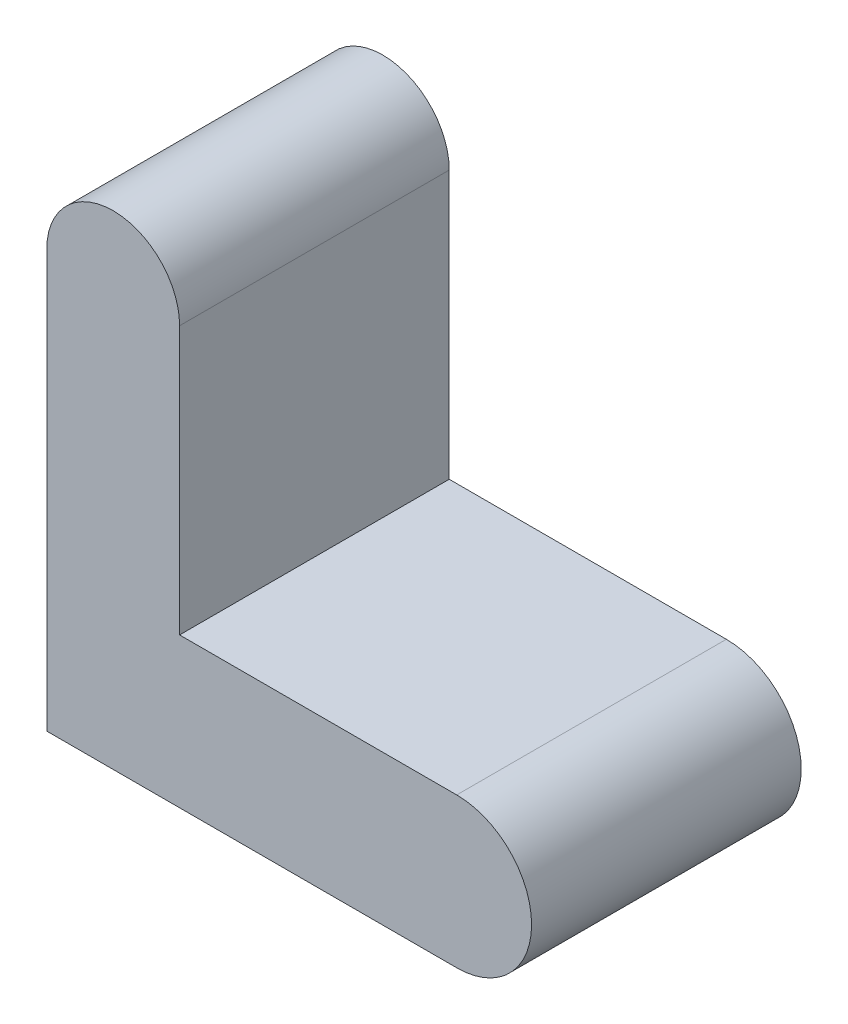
from build123d import *

# Parameters (mm, degrees)
BOSS_EXTRUDE1_START = 30
BOSS_EXTRUDE1_DEPTH = 70


with BuildPart() as part:
    # Sketch1 → Boss-Extrude1 (new body)
    with BuildSketch(Plane.XY.offset(BOSS_EXTRUDE1_START)):
        with BuildLine():
            Line((-61.303638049, -19.434884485), (45.12628912, -19.434884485))
            ThreePointArc((45.12628912, -19.434884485), (64.561173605, 0), (45.12628912, 19.434884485))
            Line((45.12628912, 19.434884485), (-26.820341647, 19.434884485))
            Line((-26.820341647, 19.434884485), (-26.820341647, 88.954375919))
            ThreePointArc((-26.820341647, 88.954375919), (-44.061989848, 106.196024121), (-61.303638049, 88.954375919))
            Line((-61.303638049, 88.954375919), (-61.303638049, -19.434884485))
        make_face()
    extrude(amount=BOSS_EXTRUDE1_DEPTH)


solid = part.part
